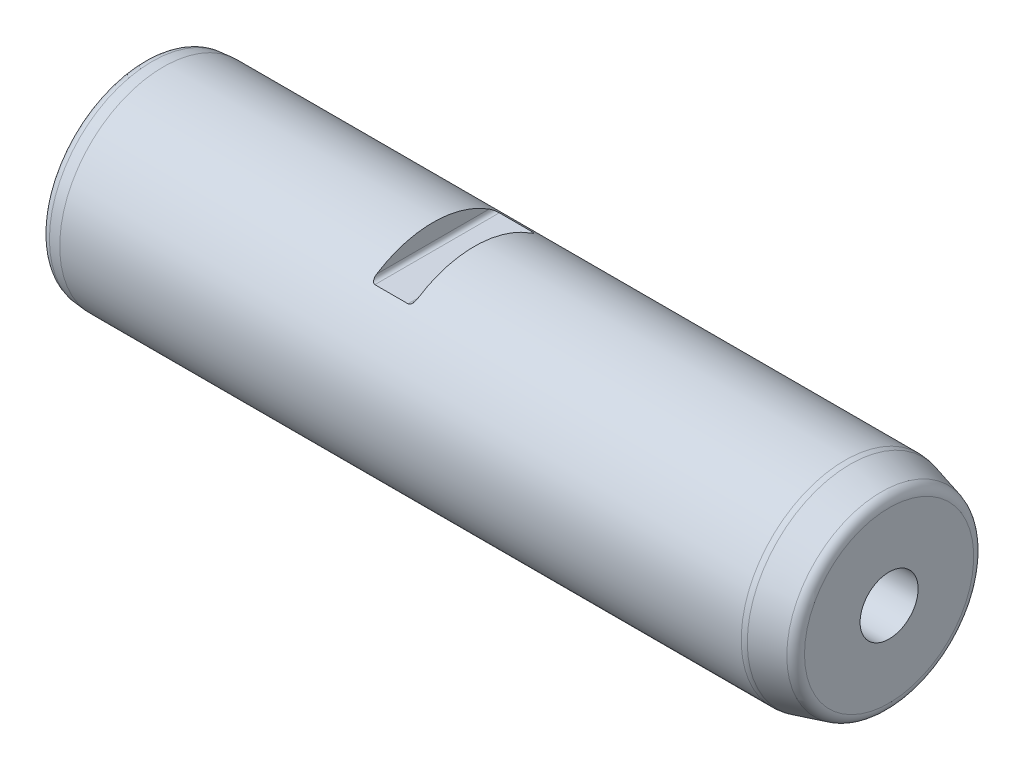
ISO-10303-21;
HEADER;
FILE_DESCRIPTION(('STEP AP214'),'2;1');
FILE_NAME('part.step','',(''),(''),'','','');
FILE_SCHEMA(('AUTOMOTIVE_DESIGN { 1 0 10303 214 1 1 1 1 }'));
ENDSEC;
DATA;
#1=APPLICATION_CONTEXT('core data for automotive mechanical design processes');
#2=APPLICATION_PROTOCOL_DEFINITION('international standard','automotive_design',2000,#1);
#3=PRODUCT_CONTEXT('',#1,'mechanical');
#4=PRODUCT('Part','Part','',(#3));
#5=PRODUCT_RELATED_PRODUCT_CATEGORY('part','',(#4));
#6=PRODUCT_DEFINITION_FORMATION('','',#4);
#7=PRODUCT_DEFINITION_CONTEXT('part definition',#1,'design');
#8=PRODUCT_DEFINITION('design','',#6,#7);
#9=PRODUCT_DEFINITION_SHAPE('','',#8);
#10=(LENGTH_UNIT() NAMED_UNIT(*) SI_UNIT(.MILLI.,.METRE.));
#11=(NAMED_UNIT(*) PLANE_ANGLE_UNIT() SI_UNIT($,.RADIAN.));
#12=(NAMED_UNIT(*) SI_UNIT($,.STERADIAN.) SOLID_ANGLE_UNIT());
#13=UNCERTAINTY_MEASURE_WITH_UNIT(LENGTH_MEASURE(1.E-05),#10,'distance_accuracy_value','');
#14=(GEOMETRIC_REPRESENTATION_CONTEXT(3) GLOBAL_UNCERTAINTY_ASSIGNED_CONTEXT((#13)) GLOBAL_UNIT_ASSIGNED_CONTEXT((#10,
#11,#12)) REPRESENTATION_CONTEXT('',''));
#15=CARTESIAN_POINT('',(0.,0.,0.));
#16=DIRECTION('',(0.,0.,1.));
#17=DIRECTION('',(1.,0.,0.));
#18=AXIS2_PLACEMENT_3D('',#15,#16,#17);
#19=CARTESIAN_POINT('',(0.,0.,0.));
#20=DIRECTION('',(1.,0.,0.));
#21=DIRECTION('',(0.,0.,-1.));
#22=AXIS2_PLACEMENT_3D('',#19,#20,#21);
#23=PLANE('',#22);
#24=CARTESIAN_POINT('',(0.,0.,0.));
#25=DIRECTION('',(1.,0.,0.));
#26=DIRECTION('',(0.,0.,-1.));
#27=AXIS2_PLACEMENT_3D('',#24,#25,#26);
#28=CIRCLE('',#27,22.2717287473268);
#29=CARTESIAN_POINT('',(0.,0.,-22.2717287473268));
#30=VERTEX_POINT('',#29);
#31=EDGE_CURVE('E160',#30,#30,#28,.F.);
#32=ORIENTED_EDGE('',*,*,#31,.T.);
#33=EDGE_LOOP('',(#32));
#34=FACE_BOUND('',#33,.T.);
#35=ADVANCED_FACE('F15',(#34),#23,.F.);
#36=CARTESIAN_POINT('',(0.,0.,0.));
#37=DIRECTION('',(-1.,0.,0.));
#38=DIRECTION('',(0.,0.,1.));
#39=AXIS2_PLACEMENT_3D('',#36,#37,#38);
#40=CYLINDRICAL_SURFACE('',#39,25.);
#41=CARTESIAN_POINT('',(79.,20.,-15.));
#42=CARTESIAN_POINT('',(79.0204326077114,19.9999962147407,-15.0000046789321));
#43=CARTESIAN_POINT('',(79.0408503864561,20.0006268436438,-14.99916423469));
#44=CARTESIAN_POINT('',(79.0814530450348,20.0031161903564,-14.9958444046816));
#45=CARTESIAN_POINT('',(79.1016381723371,20.0049734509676,-14.993366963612));
#46=CARTESIAN_POINT('',(79.1611193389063,20.0122659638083,-14.9836336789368));
#47=CARTESIAN_POINT('',(79.1998541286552,20.0194241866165,-14.9740740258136));
#48=CARTESIAN_POINT('',(79.274391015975,20.0376163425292,-14.9497209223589));
#49=CARTESIAN_POINT('',(79.3102051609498,20.048633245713,-14.9349504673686));
#50=CARTESIAN_POINT('',(79.378696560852,20.0737580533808,-14.9011638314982));
#51=CARTESIAN_POINT('',(79.411363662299,20.0878755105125,-14.8821345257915));
#52=CARTESIAN_POINT('',(79.4896711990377,20.1264955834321,-14.8298921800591));
#53=CARTESIAN_POINT('',(79.5330744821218,20.1525500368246,-14.7944897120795));
#54=CARTESIAN_POINT('',(79.612543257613,20.2080720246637,-14.7185614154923));
#55=CARTESIAN_POINT('',(79.6485941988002,20.2375461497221,-14.6780256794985));
#56=CARTESIAN_POINT('',(79.707944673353,20.2928022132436,-14.6015056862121));
#57=CARTESIAN_POINT('',(79.7323659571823,20.3182250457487,-14.5661150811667));
#58=CARTESIAN_POINT('',(79.7773623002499,20.3700125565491,-14.4936048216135));
#59=CARTESIAN_POINT('',(79.7979348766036,20.3963778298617,-14.4564840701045));
#60=CARTESIAN_POINT('',(79.8545876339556,20.4765627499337,-14.3429056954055));
#61=CARTESIAN_POINT('',(79.8854357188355,20.5313064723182,-14.2644598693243));
#62=CARTESIAN_POINT('',(79.926216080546,20.6210933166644,-14.1341533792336));
#63=CARTESIAN_POINT('',(79.9396653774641,20.655945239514,-14.0831742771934));
#64=CARTESIAN_POINT('',(79.9623501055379,20.7257206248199,-13.9802847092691));
#65=CARTESIAN_POINT('',(79.9715835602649,20.760644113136,-13.9283738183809));
#66=CARTESIAN_POINT('',(79.986039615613,20.829829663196,-13.8246889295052));
#67=CARTESIAN_POINT('',(79.9913190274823,20.8640939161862,-13.7729240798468));
#68=CARTESIAN_POINT('',(79.9982907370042,20.9323059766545,-13.6690320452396));
#69=CARTESIAN_POINT('',(79.9999872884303,20.9662541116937,-13.6169053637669));
#70=CARTESIAN_POINT('',(80.,21.,-13.5646599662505));
#71=B_SPLINE_CURVE_WITH_KNOTS('',3,(#41,#42,#43,#44,#45,#46,#47,#48,#49,#50,#51,#52,#53,#54,#55,
#56,#57,#58,#59,#60,#61,#62,#63,#64,#65,#66,#67,#68,#69,#70),.UNSPECIFIED.,.F.,.F.,(4,2,2,2,2,2,
2,2,2,2,2,2,2,2,4),(0.,0.0612433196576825,0.122414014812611,0.243243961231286,0.363547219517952,
0.48422645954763,0.66851208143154,0.853158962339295,1.00280656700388,1.15255038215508,
1.4530090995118,1.64250050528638,1.83208065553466,2.01888173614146,2.20546091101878),.UNSPECIFIED.);
#72=CARTESIAN_POINT('',(79.,20.,-15.));
#73=VERTEX_POINT('',#72);
#74=CARTESIAN_POINT('',(80.,21.,-13.5646599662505));
#75=VERTEX_POINT('',#74);
#76=EDGE_CURVE('E206',#73,#75,#71,.T.);
#77=ORIENTED_EDGE('',*,*,#76,.T.);
#78=CARTESIAN_POINT('',(80.,0.,0.));
#79=DIRECTION('',(1.,0.,0.));
#80=DIRECTION('',(0.,0.,-1.));
#81=AXIS2_PLACEMENT_3D('',#78,#79,#80);
#82=CIRCLE('',#81,25.);
#83=CARTESIAN_POINT('',(80.,21.,13.5646599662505));
#84=VERTEX_POINT('',#83);
#85=EDGE_CURVE('E9',#75,#84,#82,.T.);
#86=ORIENTED_EDGE('',*,*,#85,.T.);
#87=CARTESIAN_POINT('',(80.,21.,13.5646599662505));
#88=CARTESIAN_POINT('',(79.999955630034,20.9542327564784,13.6355224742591));
#89=CARTESIAN_POINT('',(79.9968527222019,20.9080699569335,13.7061939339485));
#90=CARTESIAN_POINT('',(79.9838958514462,20.8150990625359,13.8469758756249));
#91=CARTESIAN_POINT('',(79.9740089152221,20.7682889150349,13.9170819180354));
#92=CARTESIAN_POINT('',(79.9467162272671,20.6742032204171,14.056474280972));
#93=CARTESIAN_POINT('',(79.929243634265,20.6269272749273,14.1257475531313));
#94=CARTESIAN_POINT('',(79.8857890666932,20.5330392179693,14.2618757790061));
#95=CARTESIAN_POINT('',(79.8598269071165,20.4864258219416,14.3287359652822));
#96=CARTESIAN_POINT('',(79.8073455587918,20.4086672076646,14.4391617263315));
#97=CARTESIAN_POINT('',(79.78337733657,20.3771135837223,14.4836486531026));
#98=CARTESIAN_POINT('',(79.7299895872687,20.3153235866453,14.5701902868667));
#99=CARTESIAN_POINT('',(79.7005747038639,20.2850861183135,14.6122470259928));
#100=CARTESIAN_POINT('',(79.6352592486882,20.2264422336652,14.6933167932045));
#101=CARTESIAN_POINT('',(79.5993032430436,20.1980545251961,14.7322993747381));
#102=CARTESIAN_POINT('',(79.5203001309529,20.1446922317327,14.8051816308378));
#103=CARTESIAN_POINT('',(79.4772638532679,20.1197125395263,14.8390889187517));
#104=CARTESIAN_POINT('',(79.399061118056,20.0824152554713,14.8895010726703));
#105=CARTESIAN_POINT('',(79.365934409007,20.0686302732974,14.908068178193));
#106=CARTESIAN_POINT('',(79.296557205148,20.0442807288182,14.9407906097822));
#107=CARTESIAN_POINT('',(79.2603170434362,20.0337060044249,14.9549598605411));
#108=CARTESIAN_POINT('',(79.1874516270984,20.0170610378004,14.9772311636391));
#109=CARTESIAN_POINT('',(79.150978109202,20.0107598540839,14.9856445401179));
#110=CARTESIAN_POINT('',(79.0951306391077,20.0043553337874,14.9941915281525));
#111=CARTESIAN_POINT('',(79.0762205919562,20.0027279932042,14.9963621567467));
#112=CARTESIAN_POINT('',(79.0382110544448,20.0005483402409,14.999268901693));
#113=CARTESIAN_POINT('',(79.0191113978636,19.9999970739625,15.0000036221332));
#114=CARTESIAN_POINT('',(79.,20.,15.));
#115=B_SPLINE_CURVE_WITH_KNOTS('',3,(#87,#88,#89,#90,#91,#92,#93,#94,#95,#96,#97,#98,#99,#100,
#101,#102,#103,#104,#105,#106,#107,#108,#109,#110,#111,#112,#113,#114),.UNSPECIFIED.,.F.,.F.,(4,
2,2,2,2,2,2,2,2,2,2,2,2,4),(0.,0.253099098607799,0.507437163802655,0.764063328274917,
1.02009474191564,1.19857022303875,1.37689423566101,1.55680656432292,1.73644624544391,
1.85724328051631,1.97765384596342,2.09088655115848,2.14812113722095,2.20541133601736),.UNSPECIFIED.);
#116=CARTESIAN_POINT('',(79.,20.,15.));
#117=VERTEX_POINT('',#116);
#118=EDGE_CURVE('E23',#84,#117,#115,.T.);
#119=ORIENTED_EDGE('',*,*,#118,.T.);
#120=DIRECTION('',(-1.,0.,0.));
#121=VECTOR('',#120,1.);
#122=CARTESIAN_POINT('',(0.,20.,15.));
#123=LINE('',#122,#121);
#124=CARTESIAN_POINT('',(71.,20.,15.));
#125=VERTEX_POINT('',#124);
#126=EDGE_CURVE('E74',#117,#125,#123,.T.);
#127=ORIENTED_EDGE('',*,*,#126,.T.);
#128=CARTESIAN_POINT('',(71.,20.,15.));
#129=CARTESIAN_POINT('',(70.9795673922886,19.9999962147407,15.0000046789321));
#130=CARTESIAN_POINT('',(70.9591496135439,20.0006268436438,14.99916423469));
#131=CARTESIAN_POINT('',(70.9185469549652,20.0031161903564,14.9958444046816));
#132=CARTESIAN_POINT('',(70.8983618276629,20.0049734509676,14.993366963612));
#133=CARTESIAN_POINT('',(70.8388806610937,20.0122659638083,14.9836336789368));
#134=CARTESIAN_POINT('',(70.8001458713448,20.0194241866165,14.9740740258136));
#135=CARTESIAN_POINT('',(70.725608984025,20.0376163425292,14.9497209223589));
#136=CARTESIAN_POINT('',(70.6897948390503,20.048633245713,14.9349504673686));
#137=CARTESIAN_POINT('',(70.6213034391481,20.0737580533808,14.9011638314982));
#138=CARTESIAN_POINT('',(70.5886363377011,20.0878755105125,14.8821345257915));
#139=CARTESIAN_POINT('',(70.5103288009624,20.1264955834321,14.8298921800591));
#140=CARTESIAN_POINT('',(70.4669255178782,20.1525500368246,14.7944897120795));
#141=CARTESIAN_POINT('',(70.3874567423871,20.2080720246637,14.7185614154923));
#142=CARTESIAN_POINT('',(70.3514058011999,20.2375461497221,14.6780256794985));
#143=CARTESIAN_POINT('',(70.292055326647,20.2928022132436,14.6015056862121));
#144=CARTESIAN_POINT('',(70.2676340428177,20.3182250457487,14.5661150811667));
#145=CARTESIAN_POINT('',(70.2226376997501,20.3700125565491,14.4936048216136));
#146=CARTESIAN_POINT('',(70.2020651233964,20.3963778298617,14.4564840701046));
#147=CARTESIAN_POINT('',(70.1454123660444,20.4765627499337,14.3429056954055));
#148=CARTESIAN_POINT('',(70.1145642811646,20.5313064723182,14.2644598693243));
#149=CARTESIAN_POINT('',(70.0737839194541,20.6210933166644,14.1341533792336));
#150=CARTESIAN_POINT('',(70.060334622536,20.655945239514,14.0831742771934));
#151=CARTESIAN_POINT('',(70.0376498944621,20.7257206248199,13.9802847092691));
#152=CARTESIAN_POINT('',(70.0284164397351,20.760644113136,13.9283738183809));
#153=CARTESIAN_POINT('',(70.013960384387,20.829829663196,13.8246889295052));
#154=CARTESIAN_POINT('',(70.0086809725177,20.8640939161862,13.7729240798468));
#155=CARTESIAN_POINT('',(70.0017092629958,20.9323059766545,13.6690320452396));
#156=CARTESIAN_POINT('',(70.0000127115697,20.9662541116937,13.6169053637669));
#157=CARTESIAN_POINT('',(70.,21.,13.5646599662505));
#158=B_SPLINE_CURVE_WITH_KNOTS('',3,(#128,#129,#130,#131,#132,#133,#134,#135,#136,#137,#138,
#139,#140,#141,#142,#143,#144,#145,#146,#147,#148,#149,#150,#151,#152,#153,#154,#155,#156,#157),
.UNSPECIFIED.,.F.,.F.,(4,2,2,2,2,2,2,2,2,2,2,2,2,2,4),(0.,0.0612433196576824,0.122414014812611,
0.243243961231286,0.363547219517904,0.48422645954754,0.668512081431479,0.853158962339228,
1.00280656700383,1.15255038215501,1.45300909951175,1.64250050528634,1.83208065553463,
2.01888173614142,2.20546091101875),.UNSPECIFIED.);
#159=CARTESIAN_POINT('',(70.,21.,13.5646599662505));
#160=VERTEX_POINT('',#159);
#161=EDGE_CURVE('E65',#125,#160,#158,.T.);
#162=ORIENTED_EDGE('',*,*,#161,.T.);
#163=CARTESIAN_POINT('',(70.,0.,0.));
#164=DIRECTION('',(-1.,0.,0.));
#165=DIRECTION('',(0.,-1.,0.));
#166=AXIS2_PLACEMENT_3D('',#163,#164,#165);
#167=CIRCLE('',#166,25.);
#168=CARTESIAN_POINT('',(70.,21.,-13.5646599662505));
#169=VERTEX_POINT('',#168);
#170=EDGE_CURVE('E54',#160,#169,#167,.T.);
#171=ORIENTED_EDGE('',*,*,#170,.T.);
#172=CARTESIAN_POINT('',(70.,21.,-13.5646599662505));
#173=CARTESIAN_POINT('',(70.000044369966,20.9542327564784,-13.6355224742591));
#174=CARTESIAN_POINT('',(70.0031472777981,20.9080699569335,-13.7061939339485));
#175=CARTESIAN_POINT('',(70.0161041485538,20.8150990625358,-13.846975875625));
#176=CARTESIAN_POINT('',(70.0259910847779,20.7682889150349,-13.9170819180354));
#177=CARTESIAN_POINT('',(70.0532837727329,20.674203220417,-14.056474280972));
#178=CARTESIAN_POINT('',(70.070756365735,20.6269272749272,-14.1257475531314));
#179=CARTESIAN_POINT('',(70.1142109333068,20.5330392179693,-14.2618757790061));
#180=CARTESIAN_POINT('',(70.1401730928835,20.4864258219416,-14.3287359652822));
#181=CARTESIAN_POINT('',(70.1926544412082,20.4086672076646,-14.4391617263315));
#182=CARTESIAN_POINT('',(70.21662266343,20.3771135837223,-14.4836486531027));
#183=CARTESIAN_POINT('',(70.2700104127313,20.3153235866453,-14.5701902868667));
#184=CARTESIAN_POINT('',(70.2994252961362,20.2850861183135,-14.6122470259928));
#185=CARTESIAN_POINT('',(70.3647407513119,20.2264422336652,-14.6933167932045));
#186=CARTESIAN_POINT('',(70.4006967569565,20.1980545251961,-14.7322993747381));
#187=CARTESIAN_POINT('',(70.4796998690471,20.1446922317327,-14.8051816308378));
#188=CARTESIAN_POINT('',(70.5227361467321,20.1197125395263,-14.8390889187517));
#189=CARTESIAN_POINT('',(70.600938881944,20.0824152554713,-14.8895010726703));
#190=CARTESIAN_POINT('',(70.634065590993,20.0686302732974,-14.908068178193));
#191=CARTESIAN_POINT('',(70.7034427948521,20.0442807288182,-14.9407906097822));
#192=CARTESIAN_POINT('',(70.7396829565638,20.0337060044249,-14.9549598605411));
#193=CARTESIAN_POINT('',(70.8125483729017,20.0170610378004,-14.9772311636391));
#194=CARTESIAN_POINT('',(70.8490218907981,20.0107598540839,-14.9856445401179));
#195=CARTESIAN_POINT('',(70.9048693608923,20.0043553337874,-14.9941915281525));
#196=CARTESIAN_POINT('',(70.9237794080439,20.0027279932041,-14.9963621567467));
#197=CARTESIAN_POINT('',(70.9617889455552,20.0005483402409,-14.999268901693));
#198=CARTESIAN_POINT('',(70.9808886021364,19.9999970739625,-15.0000036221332));
#199=CARTESIAN_POINT('',(71.,20.,-15.));
#200=B_SPLINE_CURVE_WITH_KNOTS('',3,(#172,#173,#174,#175,#176,#177,#178,#179,#180,#181,#182,
#183,#184,#185,#186,#187,#188,#189,#190,#191,#192,#193,#194,#195,#196,#197,#198,#199),
.UNSPECIFIED.,.F.,.F.,(4,2,2,2,2,2,2,2,2,2,2,2,2,4),(0.,0.253099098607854,0.507437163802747,
0.764063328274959,1.02009474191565,1.19857022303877,1.37689423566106,1.55680656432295,
1.7364462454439,1.85724328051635,1.97765384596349,2.09088655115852,2.14812113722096,
2.20541133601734),.UNSPECIFIED.);
#201=CARTESIAN_POINT('',(71.,20.,-15.));
#202=VERTEX_POINT('',#201);
#203=EDGE_CURVE('E59',#169,#202,#200,.T.);
#204=ORIENTED_EDGE('',*,*,#203,.T.);
#205=DIRECTION('',(-1.,0.,0.));
#206=VECTOR('',#205,1.);
#207=CARTESIAN_POINT('',(0.,20.,-15.));
#208=LINE('',#207,#206);
#209=EDGE_CURVE('E75',#202,#73,#208,.F.);
#210=ORIENTED_EDGE('',*,*,#209,.T.);
#211=EDGE_LOOP('',(#77,#86,#119,#127,#162,#171,#204,#210));
#212=FACE_BOUND('',#211,.T.);
#213=CARTESIAN_POINT('',(5.00000000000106,0.,0.));
#214=DIRECTION('',(1.,0.,0.));
#215=DIRECTION('',(0.,0.,-1.));
#216=AXIS2_PLACEMENT_3D('',#213,#214,#215);
#217=CIRCLE('',#216,25.);
#218=CARTESIAN_POINT('',(5.00000000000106,0.,-25.));
#219=VERTEX_POINT('',#218);
#220=EDGE_CURVE('E159',#219,#219,#217,.T.);
#221=ORIENTED_EDGE('',*,*,#220,.T.);
#222=EDGE_LOOP('',(#221));
#223=FACE_BOUND('',#222,.T.);
#224=CARTESIAN_POINT('',(169.341737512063,0.,0.));
#225=DIRECTION('',(1.,0.,0.));
#226=DIRECTION('',(0.,0.,-1.));
#227=AXIS2_PLACEMENT_3D('',#224,#225,#226);
#228=CIRCLE('',#227,25.);
#229=CARTESIAN_POINT('',(169.341737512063,0.,-25.));
#230=VERTEX_POINT('',#229);
#231=EDGE_CURVE('E177',#230,#230,#228,.F.);
#232=ORIENTED_EDGE('',*,*,#231,.T.);
#233=EDGE_LOOP('',(#232));
#234=FACE_BOUND('',#233,.T.);
#235=ADVANCED_FACE('F71',(#212,#223,#234),#40,.T.);
#236=CARTESIAN_POINT('',(180.,0.,0.));
#237=DIRECTION('',(-1.,0.,0.));
#238=DIRECTION('',(0.,0.,1.));
#239=AXIS2_PLACEMENT_3D('',#236,#237,#238);
#240=CONICAL_SURFACE('',#239,22.3205080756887,0.26179938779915);
#241=CARTESIAN_POINT('',(178.147047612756,0.,0.));
#242=DIRECTION('',(1.,0.,0.));
#243=DIRECTION('',(0.,0.,-1.));
#244=AXIS2_PLACEMENT_3D('',#241,#242,#243);
#245=CIRCLE('',#244,22.817005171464);
#246=CARTESIAN_POINT('',(178.147047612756,0.,-22.817005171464));
#247=VERTEX_POINT('',#246);
#248=EDGE_CURVE('E165',#247,#247,#245,.F.);
#249=ORIENTED_EDGE('',*,*,#248,.T.);
#250=EDGE_LOOP('',(#249));
#251=FACE_BOUND('',#250,.T.);
#252=CARTESIAN_POINT('',(170.635832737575,0.,0.));
#253=DIRECTION('',(1.,0.,0.));
#254=DIRECTION('',(0.,0.,-1.));
#255=AXIS2_PLACEMENT_3D('',#252,#253,#254);
#256=CIRCLE('',#255,24.8296291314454);
#257=CARTESIAN_POINT('',(170.635832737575,0.,-24.8296291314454));
#258=VERTEX_POINT('',#257);
#259=EDGE_CURVE('E190',#258,#258,#256,.T.);
#260=ORIENTED_EDGE('',*,*,#259,.T.);
#261=EDGE_LOOP('',(#260));
#262=FACE_BOUND('',#261,.T.);
#263=ADVANCED_FACE('F122',(#251,#262),#240,.T.);
#264=CARTESIAN_POINT('',(180.,22.3205080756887,0.));
#265=DIRECTION('',(-1.,0.,0.));
#266=DIRECTION('',(0.,0.,1.));
#267=AXIS2_PLACEMENT_3D('',#264,#265,#266);
#268=PLANE('',#267);
#269=CARTESIAN_POINT('',(180.,0.,0.));
#270=DIRECTION('',(1.,0.,0.));
#271=DIRECTION('',(0.,0.,-1.));
#272=AXIS2_PLACEMENT_3D('',#269,#270,#271);
#273=CIRCLE('',#272,7.);
#274=CARTESIAN_POINT('',(180.,0.,-7.));
#275=VERTEX_POINT('',#274);
#276=EDGE_CURVE('E180',#275,#275,#273,.T.);
#277=ORIENTED_EDGE('',*,*,#276,.F.);
#278=EDGE_LOOP('',(#277));
#279=FACE_BOUND('',#278,.T.);
#280=CARTESIAN_POINT('',(180.,0.,0.));
#281=DIRECTION('',(-1.,0.,0.));
#282=DIRECTION('',(0.,0.,1.));
#283=AXIS2_PLACEMENT_3D('',#280,#281,#282);
#284=CIRCLE('',#283,20.4021906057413);
#285=CARTESIAN_POINT('',(180.,0.,20.4021906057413));
#286=VERTEX_POINT('',#285);
#287=EDGE_CURVE('E161',#286,#286,#284,.F.);
#288=ORIENTED_EDGE('',*,*,#287,.T.);
#289=EDGE_LOOP('',(#288));
#290=FACE_BOUND('',#289,.T.);
#291=ADVANCED_FACE('F119',(#279,#290),#268,.F.);
#292=CARTESIAN_POINT('',(169.341737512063,0.,0.));
#293=DIRECTION('',(1.,0.,0.));
#294=DIRECTION('',(0.,0.,-1.));
#295=AXIS2_PLACEMENT_3D('',#292,#293,#294);
#296=TOROIDAL_SURFACE('',#295,20.,5.);
#297=ORIENTED_EDGE('',*,*,#259,.F.);
#298=EDGE_LOOP('',(#297));
#299=FACE_BOUND('',#298,.T.);
#300=ORIENTED_EDGE('',*,*,#231,.F.);
#301=EDGE_LOOP('',(#300));
#302=FACE_BOUND('',#301,.T.);
#303=ADVANCED_FACE('F121',(#299,#302),#296,.T.);
#304=CARTESIAN_POINT('',(177.5,0.,0.));
#305=DIRECTION('',(-1.,0.,0.));
#306=DIRECTION('',(0.,0.,1.));
#307=AXIS2_PLACEMENT_3D('',#304,#305,#306);
#308=TOROIDAL_SURFACE('',#307,20.4021906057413,2.5);
#309=ORIENTED_EDGE('',*,*,#287,.F.);
#310=EDGE_LOOP('',(#309));
#311=FACE_BOUND('',#310,.T.);
#312=ORIENTED_EDGE('',*,*,#248,.F.);
#313=EDGE_LOOP('',(#312));
#314=FACE_BOUND('',#313,.T.);
#315=ADVANCED_FACE('F142',(#311,#314),#308,.T.);
#316=CARTESIAN_POINT('',(0.,0.,0.));
#317=DIRECTION('',(1.,0.,0.));
#318=DIRECTION('',(0.,0.,-1.));
#319=AXIS2_PLACEMENT_3D('',#316,#317,#318);
#320=CONICAL_SURFACE('',#319,24.5625566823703,0.0872664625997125);
#321=CARTESIAN_POINT('',(2.28211064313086,0.,0.));
#322=DIRECTION('',(1.,0.,0.));
#323=DIRECTION('',(0.,0.,-1.));
#324=AXIS2_PLACEMENT_3D('',#321,#322,#323);
#325=CIRCLE('',#324,24.7622154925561);
#326=CARTESIAN_POINT('',(2.28211064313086,0.,-24.7622154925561));
#327=VERTEX_POINT('',#326);
#328=EDGE_CURVE('E60',#327,#327,#325,.T.);
#329=ORIENTED_EDGE('',*,*,#328,.T.);
#330=EDGE_LOOP('',(#329));
#331=FACE_BOUND('',#330,.T.);
#332=ORIENTED_EDGE('',*,*,#220,.F.);
#333=EDGE_LOOP('',(#332));
#334=FACE_BOUND('',#333,.T.);
#335=ADVANCED_FACE('F145',(#331,#334),#320,.T.);
#336=CARTESIAN_POINT('',(2.5,0.,0.));
#337=DIRECTION('',(1.,0.,0.));
#338=DIRECTION('',(0.,0.,-1.));
#339=AXIS2_PLACEMENT_3D('',#336,#337,#338);
#340=TOROIDAL_SURFACE('',#339,22.2717287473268,2.5);
#341=ORIENTED_EDGE('',*,*,#328,.F.);
#342=EDGE_LOOP('',(#341));
#343=FACE_BOUND('',#342,.T.);
#344=ORIENTED_EDGE('',*,*,#31,.F.);
#345=EDGE_LOOP('',(#344));
#346=FACE_BOUND('',#345,.T.);
#347=ADVANCED_FACE('F17',(#343,#346),#340,.T.);
#348=CARTESIAN_POINT('',(156.,0.,0.));
#349=DIRECTION('',(1.,0.,0.));
#350=DIRECTION('',(0.,0.,-1.));
#351=AXIS2_PLACEMENT_3D('',#348,#349,#350);
#352=PLANE('',#351);
#353=CARTESIAN_POINT('',(156.,0.,0.));
#354=DIRECTION('',(1.,0.,0.));
#355=DIRECTION('',(0.,0.,-1.));
#356=AXIS2_PLACEMENT_3D('',#353,#354,#355);
#357=CIRCLE('',#356,7.);
#358=CARTESIAN_POINT('',(156.,0.,-7.));
#359=VERTEX_POINT('',#358);
#360=EDGE_CURVE('E173',#359,#359,#357,.T.);
#361=ORIENTED_EDGE('',*,*,#360,.T.);
#362=EDGE_LOOP('',(#361));
#363=FACE_BOUND('',#362,.T.);
#364=CARTESIAN_POINT('',(156.,0.,0.));
#365=DIRECTION('',(1.,0.,0.));
#366=DIRECTION('',(0.,0.,-1.));
#367=AXIS2_PLACEMENT_3D('',#364,#365,#366);
#368=CIRCLE('',#367,5.1);
#369=CARTESIAN_POINT('',(156.,0.,-5.1));
#370=VERTEX_POINT('',#369);
#371=EDGE_CURVE('E170',#370,#370,#368,.F.);
#372=ORIENTED_EDGE('',*,*,#371,.T.);
#373=EDGE_LOOP('',(#372));
#374=FACE_BOUND('',#373,.T.);
#375=ADVANCED_FACE('F103',(#363,#374),#352,.T.);
#376=CARTESIAN_POINT('',(156.,0.,0.));
#377=DIRECTION('',(1.,0.,0.));
#378=DIRECTION('',(0.,0.,-1.));
#379=AXIS2_PLACEMENT_3D('',#376,#377,#378);
#380=CYLINDRICAL_SURFACE('',#379,7.);
#381=ORIENTED_EDGE('',*,*,#360,.F.);
#382=EDGE_LOOP('',(#381));
#383=FACE_BOUND('',#382,.T.);
#384=ORIENTED_EDGE('',*,*,#276,.T.);
#385=EDGE_LOOP('',(#384));
#386=FACE_BOUND('',#385,.T.);
#387=ADVANCED_FACE('F106',(#383,#386),#380,.F.);
#388=CARTESIAN_POINT('',(150.,0.,0.));
#389=DIRECTION('',(1.,0.,0.));
#390=DIRECTION('',(0.,0.,-1.));
#391=AXIS2_PLACEMENT_3D('',#388,#389,#390);
#392=CONICAL_SURFACE('',#391,5.1,1.0471975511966);
#393=CARTESIAN_POINT('',(147.055513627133,0.,0.));
#394=VERTEX_POINT('',#393);
#395=VERTEX_LOOP('',#394);
#396=FACE_BOUND('',#395,.T.);
#397=CARTESIAN_POINT('',(150.,0.,0.));
#398=DIRECTION('',(1.,0.,0.));
#399=DIRECTION('',(0.,0.,-1.));
#400=AXIS2_PLACEMENT_3D('',#397,#398,#399);
#401=CIRCLE('',#400,5.1);
#402=CARTESIAN_POINT('',(150.,0.,-5.1));
#403=VERTEX_POINT('',#402);
#404=EDGE_CURVE('E172',#403,#403,#401,.T.);
#405=ORIENTED_EDGE('',*,*,#404,.T.);
#406=EDGE_LOOP('',(#405));
#407=FACE_BOUND('',#406,.T.);
#408=ADVANCED_FACE('F110',(#396,#407),#392,.F.);
#409=CARTESIAN_POINT('',(180.,0.,0.));
#410=DIRECTION('',(1.,0.,0.));
#411=DIRECTION('',(0.,0.,-1.));
#412=AXIS2_PLACEMENT_3D('',#409,#410,#411);
#413=CYLINDRICAL_SURFACE('',#412,5.1);
#414=ORIENTED_EDGE('',*,*,#404,.F.);
#415=EDGE_LOOP('',(#414));
#416=FACE_BOUND('',#415,.T.);
#417=ORIENTED_EDGE('',*,*,#371,.F.);
#418=EDGE_LOOP('',(#417));
#419=FACE_BOUND('',#418,.T.);
#420=ADVANCED_FACE('F112',(#416,#419),#413,.F.);
#421=CARTESIAN_POINT('',(80.,21.,-25.));
#422=DIRECTION('',(1.,0.,0.));
#423=DIRECTION('',(0.,0.,-1.));
#424=AXIS2_PLACEMENT_3D('',#421,#422,#423);
#425=PLANE('',#424);
#426=DIRECTION('',(0.,0.,1.));
#427=VECTOR('',#426,1.);
#428=CARTESIAN_POINT('',(80.,21.,-25.));
#429=LINE('',#428,#427);
#430=EDGE_CURVE('E184',#75,#84,#429,.T.);
#431=ORIENTED_EDGE('',*,*,#430,.T.);
#432=ORIENTED_EDGE('',*,*,#85,.F.);
#433=EDGE_LOOP('',(#431,#432));
#434=FACE_BOUND('',#433,.T.);
#435=ADVANCED_FACE('F115',(#434),#425,.F.);
#436=CARTESIAN_POINT('',(79.,21.,-25.));
#437=DIRECTION('',(0.,0.,1.));
#438=DIRECTION('',(1.,0.,0.));
#439=AXIS2_PLACEMENT_3D('',#436,#437,#438);
#440=CYLINDRICAL_SURFACE('',#439,1.);
#441=ORIENTED_EDGE('',*,*,#430,.F.);
#442=ORIENTED_EDGE('',*,*,#76,.F.);
#443=DIRECTION('',(0.,0.,1.));
#444=VECTOR('',#443,1.);
#445=CARTESIAN_POINT('',(79.,20.,-25.));
#446=LINE('',#445,#444);
#447=EDGE_CURVE('E199',#73,#117,#446,.T.);
#448=ORIENTED_EDGE('',*,*,#447,.T.);
#449=ORIENTED_EDGE('',*,*,#118,.F.);
#450=EDGE_LOOP('',(#441,#442,#448,#449));
#451=FACE_BOUND('',#450,.T.);
#452=ADVANCED_FACE('F217',(#451),#440,.F.);
#453=CARTESIAN_POINT('',(71.,20.,-25.));
#454=DIRECTION('',(0.,-1.,0.));
#455=DIRECTION('',(0.,0.,-1.));
#456=AXIS2_PLACEMENT_3D('',#453,#454,#455);
#457=PLANE('',#456);
#458=ORIENTED_EDGE('',*,*,#447,.F.);
#459=ORIENTED_EDGE('',*,*,#209,.F.);
#460=DIRECTION('',(0.,0.,1.));
#461=VECTOR('',#460,1.);
#462=CARTESIAN_POINT('',(71.,20.,-25.));
#463=LINE('',#462,#461);
#464=EDGE_CURVE('E67',#202,#125,#463,.T.);
#465=ORIENTED_EDGE('',*,*,#464,.T.);
#466=ORIENTED_EDGE('',*,*,#126,.F.);
#467=EDGE_LOOP('',(#458,#459,#465,#466));
#468=FACE_BOUND('',#467,.T.);
#469=ADVANCED_FACE('F98',(#468),#457,.F.);
#470=CARTESIAN_POINT('',(71.,21.,-25.));
#471=DIRECTION('',(0.,0.,1.));
#472=DIRECTION('',(1.,0.,0.));
#473=AXIS2_PLACEMENT_3D('',#470,#471,#472);
#474=CYLINDRICAL_SURFACE('',#473,1.);
#475=ORIENTED_EDGE('',*,*,#464,.F.);
#476=ORIENTED_EDGE('',*,*,#203,.F.);
#477=DIRECTION('',(0.,0.,1.));
#478=VECTOR('',#477,1.);
#479=CARTESIAN_POINT('',(70.,21.,-25.));
#480=LINE('',#479,#478);
#481=EDGE_CURVE('E29',#169,#160,#480,.T.);
#482=ORIENTED_EDGE('',*,*,#481,.T.);
#483=ORIENTED_EDGE('',*,*,#161,.F.);
#484=EDGE_LOOP('',(#475,#476,#482,#483));
#485=FACE_BOUND('',#484,.T.);
#486=ADVANCED_FACE('F64',(#485),#474,.F.);
#487=CARTESIAN_POINT('',(70.,25.,-25.));
#488=DIRECTION('',(-1.,0.,0.));
#489=DIRECTION('',(0.,-1.,0.));
#490=AXIS2_PLACEMENT_3D('',#487,#488,#489);
#491=PLANE('',#490);
#492=ORIENTED_EDGE('',*,*,#481,.F.);
#493=ORIENTED_EDGE('',*,*,#170,.F.);
#494=EDGE_LOOP('',(#492,#493));
#495=FACE_BOUND('',#494,.T.);
#496=ADVANCED_FACE('F55',(#495),#491,.F.);
#497=CLOSED_SHELL('',(#35,#235,#263,#291,#303,#315,#335,#347,#375,#387,#408,#420,#435,#452,#469,
#486,#496));
#498=MANIFOLD_SOLID_BREP('B1',#497);
#499=ADVANCED_BREP_SHAPE_REPRESENTATION('',(#18,#498),#14);
#500=SHAPE_DEFINITION_REPRESENTATION(#9,#499);
ENDSEC;
END-ISO-10303-21;
